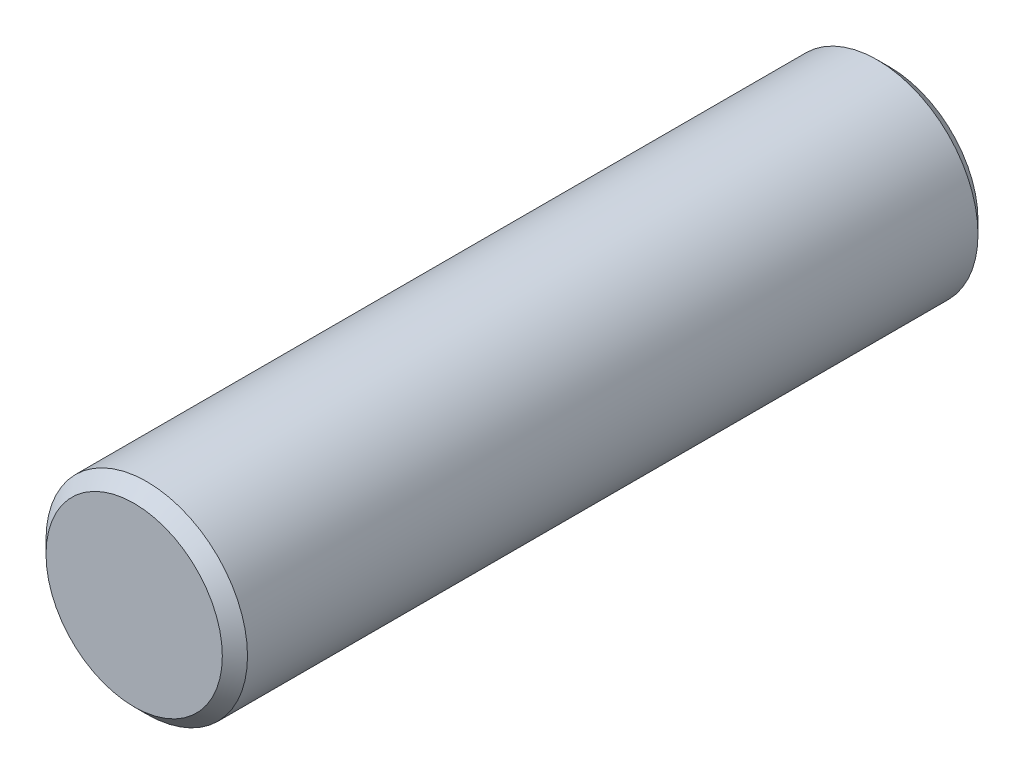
from build123d import *

# Parameters (mm, degrees)
SKETCH_1_R      = 4
EXTRUDE_1_DEPTH = 30
CHAMFER_1_SIZE  = 0.5


with BuildPart() as part:
    # Sketch 1 → Extrude 1 (new body)
    with BuildSketch(Plane.XY):
        Circle(SKETCH_1_R)
    extrude(amount=EXTRUDE_1_DEPTH)

    # Chamfer 1
    chamfer_1_edges = [part.edges().sort_by_distance(p)[0] for p in [
        (-4, 0, 0),
        (-4, 0, 30),
    ]]
    chamfer(chamfer_1_edges, length=CHAMFER_1_SIZE)


solid = part.part
